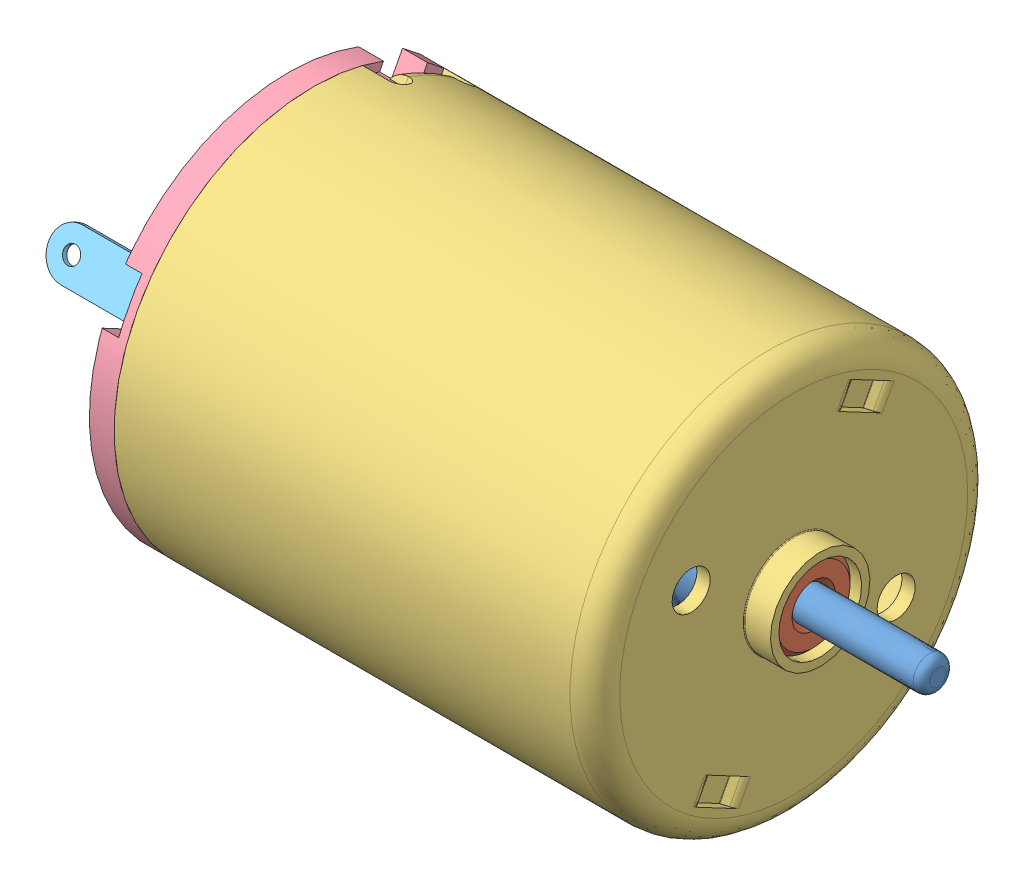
SolidWorks assembly moteur MFA 719RE280.SLDASM, configuration Défaut (file format 12000). Lengths in mm.
Overall size (44.9 32.45 32.45).
6 component instances, 5 part files, 13 mates.
Components (placement in the parent):
- rotor-1: rotor.SLDPRT [Défaut] at (-20.2373 -1.5467 0) size (42 17 16.93)
- palier-1: palier.SLDPRT [Défaut] at (12.2627 -1.5467 0) x (0 -0.979484 -0.20152) z (1 0 0) size (5 5 2)
- cage moteur Ø24-1: cage moteur Ø24.SLDPRT [Défaut] at (14.6627 -1.5467 0) x (0 0.88353 -0.468375) z (0 0.468375 0.88353) size (24 30.6 24)
- flasque moteur-1: flasque moteur.SLDPRT [Défaut] at (-13.4373 -1.5467 0) x (0 -0.468375 -0.88353) z (0 0.88353 -0.468375) size (24 6 23.81)
- patte-1: patte.SLDPRT [Défaut] at (-13.4373 -7.3998 -8.1588) x (0 0.88353 -0.468375) z (0 0.468375 0.88353) size (2.8 9.7 0.3)
- patte-2: patte.SLDPRT [Défaut] at (-13.4373 1.7804 9.1584) x (0 0.88353 -0.468375) z (0 0.468375 0.88353) size (2.8 9.7 0.3)
Mates (geometry in assembly coordinates):
- Coïncidente3: coincident aligned: plane of palier-1 through (12.2627 -1.5467 0) normal (-1 0 0); plane of cage moteur Ø24-1 through (12.2627 0.6622 -1.1709) normal (-1 0 0)
- Coaxiale3: concentric anti-aligned: cylinder of palier-1 through (14.2627 -1.5467 0) axis (-1 0 0) radius 1; circle of cage moteur Ø24-1
- Coïncidente4: coincident anti-aligned: plane of rotor-1 through (12.2627 1.2533 0) normal (1 0 0); plane of palier-1 through (12.2627 -1.5467 0) normal (-1 0 0)
- Coïncidente5: coincident anti-aligned: cylinder of rotor-1 through (-20.2373 -1.5467 0) axis (-1 0 0) radius 1; circle of palier-1
- Coaxiale5: concentric aligned: cylinder of cage moteur Ø24-1 through (14.6627 -1.5467 0) axis (1 0 0) radius 11.5; cylinder of flasque moteur-1 through (-13.4373 -1.5467 0) axis (1 0 0) radius 11.5
- Parallèle1: parallel aligned: plane of cage moteur Ø24-1 through (-12.9373 -8.272 -10.0178) normal (0 0.88353 -0.468375); plane of flasque moteur-1 through (-13.4373 -7.3215 -7.691) normal (0 0.88353 -0.468375)
- Coïncidente7: coincident anti-aligned: plane of cage moteur Ø24-1 through (-15.9373 9.0557 -5.6205) normal (-1 0 0); plane of flasque moteur-1 through (-15.9373 4.0738 10.6024) normal (1 0 0)
- Distance1: distance = 0.15 mm anti-aligned: plane of flasque moteur-1 through (-13.4373 -7.3215 -7.691) normal (0 0.88353 -0.468375); plane of patte-1 through (-21.7373 -7.2593 -7.8938) normal (0 -0.88353 0.468375)
- Distance3: distance = 0.15 mm anti-aligned: plane of flasque moteur-1 through (-13.4373 -4.6709 -9.0961) normal (0 -0.468375 -0.88353); plane of patte-1 through (-21.7373 -6.0223 -8.5495) normal (0 0.468375 0.88353)
- Parallèle5: parallel aligned: plane of flasque moteur-1 through (-13.4373 2.4345 7.51) normal (1 0 0); plane of patte-1 through (-13.4373 -7.2593 -7.8938) normal (1 0 0)
- Distance4: distance = 0.15 mm anti-aligned: plane of flasque moteur-1 through (-13.4373 1.8118 9.5379) normal (0 0.88353 -0.468375); plane of patte-2 through (-21.7373 1.9209 9.4234) normal (0 -0.88353 0.468375)
- Distance5: distance = 0.15 mm anti-aligned: plane of flasque moteur-1 through (-13.4373 1.5776 9.0961) normal (0 0.468375 0.88353); plane of patte-2 through (-21.7373 3.0173 8.5026) normal (0 -0.468375 -0.88353)
- Coïncidente13: coincident: line of flasque moteur-1 through (-13.4373 4.2282 7.691) axis (0 -0.88353 0.468375); plane of patte-2 through (-13.4373 1.9209 9.4234) normal (1 0 0)
